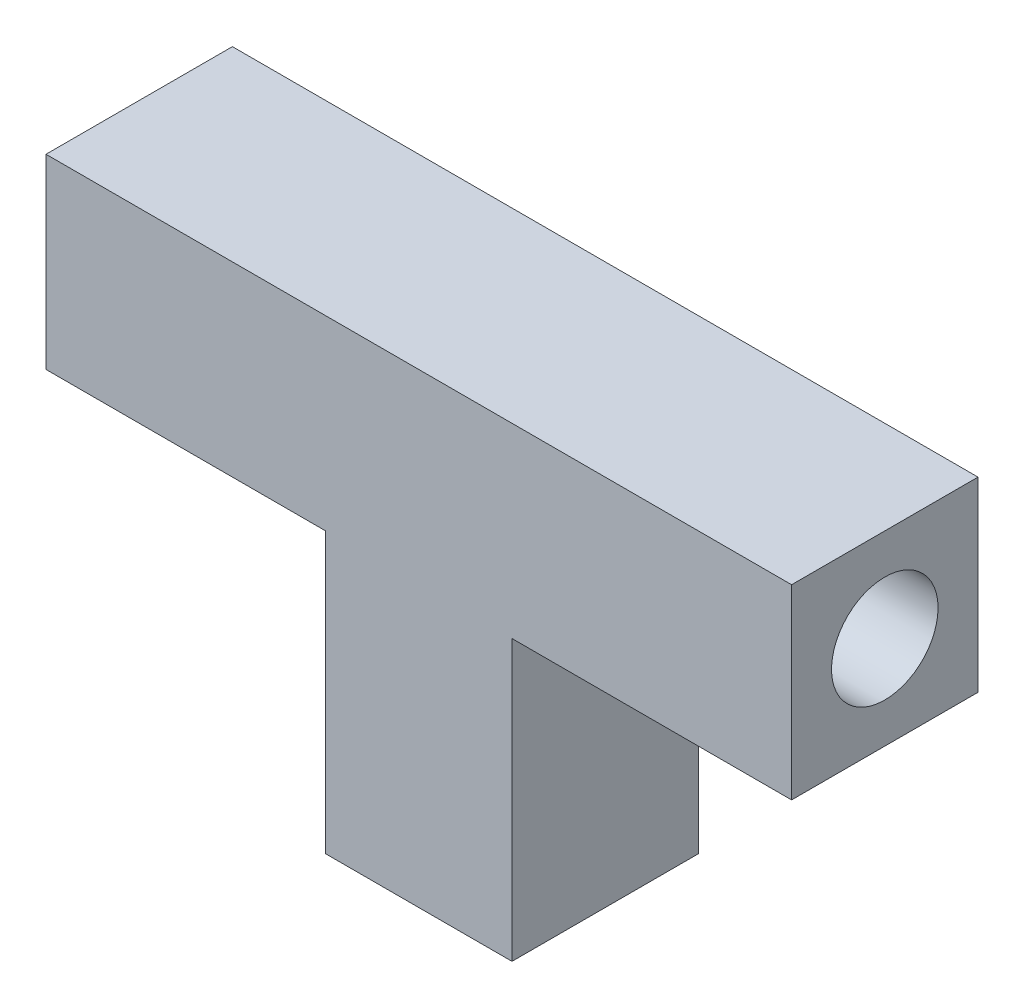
ISO-10303-21;
HEADER;
FILE_DESCRIPTION(('STEP AP214'),'2;1');
FILE_NAME('part.step','',(''),(''),'','','');
FILE_SCHEMA(('AUTOMOTIVE_DESIGN { 1 0 10303 214 1 1 1 1 }'));
ENDSEC;
DATA;
#1=APPLICATION_CONTEXT('core data for automotive mechanical design processes');
#2=APPLICATION_PROTOCOL_DEFINITION('international standard','automotive_design',2000,#1);
#3=PRODUCT_CONTEXT('',#1,'mechanical');
#4=PRODUCT('Part','Part','',(#3));
#5=PRODUCT_RELATED_PRODUCT_CATEGORY('part','',(#4));
#6=PRODUCT_DEFINITION_FORMATION('','',#4);
#7=PRODUCT_DEFINITION_CONTEXT('part definition',#1,'design');
#8=PRODUCT_DEFINITION('design','',#6,#7);
#9=PRODUCT_DEFINITION_SHAPE('','',#8);
#10=(LENGTH_UNIT() NAMED_UNIT(*) SI_UNIT(.MILLI.,.METRE.));
#11=(NAMED_UNIT(*) PLANE_ANGLE_UNIT() SI_UNIT($,.RADIAN.));
#12=(NAMED_UNIT(*) SI_UNIT($,.STERADIAN.) SOLID_ANGLE_UNIT());
#13=UNCERTAINTY_MEASURE_WITH_UNIT(LENGTH_MEASURE(1.E-05),#10,'distance_accuracy_value','');
#14=(GEOMETRIC_REPRESENTATION_CONTEXT(3) GLOBAL_UNCERTAINTY_ASSIGNED_CONTEXT((#13)) GLOBAL_UNIT_ASSIGNED_CONTEXT((#10,
#11,#12)) REPRESENTATION_CONTEXT('',''));
#15=CARTESIAN_POINT('',(0.,0.,0.));
#16=DIRECTION('',(0.,0.,1.));
#17=DIRECTION('',(1.,0.,0.));
#18=AXIS2_PLACEMENT_3D('',#15,#16,#17);
#19=CARTESIAN_POINT('',(-7.,-1.75,1.75));
#20=DIRECTION('',(1.,0.,0.));
#21=DIRECTION('',(0.,0.,-1.));
#22=AXIS2_PLACEMENT_3D('',#19,#20,#21);
#23=PLANE('',#22);
#24=CARTESIAN_POINT('',(-7.,0.,0.));
#25=DIRECTION('',(1.,0.,0.));
#26=DIRECTION('',(0.,0.,-1.));
#27=AXIS2_PLACEMENT_3D('',#24,#25,#26);
#28=CIRCLE('',#27,1.);
#29=CARTESIAN_POINT('',(-7.,0.,-1.));
#30=VERTEX_POINT('',#29);
#31=EDGE_CURVE('E153',#30,#30,#28,.T.);
#32=ORIENTED_EDGE('',*,*,#31,.T.);
#33=EDGE_LOOP('',(#32));
#34=FACE_BOUND('',#33,.T.);
#35=DIRECTION('',(0.,-1.,0.));
#36=VECTOR('',#35,1.);
#37=CARTESIAN_POINT('',(-7.,-1.75,-1.75));
#38=LINE('',#37,#36);
#39=CARTESIAN_POINT('',(-7.,1.75,-1.75));
#40=VERTEX_POINT('',#39);
#41=CARTESIAN_POINT('',(-7.,-1.75,-1.75));
#42=VERTEX_POINT('',#41);
#43=EDGE_CURVE('E148',#40,#42,#38,.T.);
#44=ORIENTED_EDGE('',*,*,#43,.T.);
#45=DIRECTION('',(0.,0.,-1.));
#46=VECTOR('',#45,1.);
#47=CARTESIAN_POINT('',(-7.,-1.75,1.75));
#48=LINE('',#47,#46);
#49=CARTESIAN_POINT('',(-7.,-1.75,1.75));
#50=VERTEX_POINT('',#49);
#51=EDGE_CURVE('E191',#50,#42,#48,.T.);
#52=ORIENTED_EDGE('',*,*,#51,.F.);
#53=DIRECTION('',(0.,-1.,0.));
#54=VECTOR('',#53,1.);
#55=CARTESIAN_POINT('',(-7.,-1.75,1.75));
#56=LINE('',#55,#54);
#57=CARTESIAN_POINT('',(-7.,1.75,1.75));
#58=VERTEX_POINT('',#57);
#59=EDGE_CURVE('E172',#58,#50,#56,.T.);
#60=ORIENTED_EDGE('',*,*,#59,.F.);
#61=DIRECTION('',(0.,0.,-1.));
#62=VECTOR('',#61,1.);
#63=CARTESIAN_POINT('',(-7.,1.75,1.75));
#64=LINE('',#63,#62);
#65=EDGE_CURVE('E144',#58,#40,#64,.T.);
#66=ORIENTED_EDGE('',*,*,#65,.T.);
#67=EDGE_LOOP('',(#44,#52,#60,#66));
#68=FACE_BOUND('',#67,.T.);
#69=ADVANCED_FACE('F39',(#34,#68),#23,.F.);
#70=CARTESIAN_POINT('',(-1.75,-1.75,1.75));
#71=DIRECTION('',(0.,1.,0.));
#72=DIRECTION('',(0.,0.,1.));
#73=AXIS2_PLACEMENT_3D('',#70,#71,#72);
#74=PLANE('',#73);
#75=DIRECTION('',(1.,0.,0.));
#76=VECTOR('',#75,1.);
#77=CARTESIAN_POINT('',(-1.75,-1.75,-1.75));
#78=LINE('',#77,#76);
#79=CARTESIAN_POINT('',(-1.75,-1.75,-1.75));
#80=VERTEX_POINT('',#79);
#81=EDGE_CURVE('E152',#42,#80,#78,.T.);
#82=ORIENTED_EDGE('',*,*,#81,.T.);
#83=DIRECTION('',(0.,0.,-1.));
#84=VECTOR('',#83,1.);
#85=CARTESIAN_POINT('',(-1.75,-1.75,1.75));
#86=LINE('',#85,#84);
#87=CARTESIAN_POINT('',(-1.75,-1.75,1.75));
#88=VERTEX_POINT('',#87);
#89=EDGE_CURVE('E187',#88,#80,#86,.T.);
#90=ORIENTED_EDGE('',*,*,#89,.F.);
#91=DIRECTION('',(1.,0.,0.));
#92=VECTOR('',#91,1.);
#93=CARTESIAN_POINT('',(-1.75,-1.75,1.75));
#94=LINE('',#93,#92);
#95=EDGE_CURVE('E102',#50,#88,#94,.T.);
#96=ORIENTED_EDGE('',*,*,#95,.F.);
#97=ORIENTED_EDGE('',*,*,#51,.T.);
#98=EDGE_LOOP('',(#82,#90,#96,#97));
#99=FACE_BOUND('',#98,.T.);
#100=ADVANCED_FACE('F208',(#99),#74,.F.);
#101=CARTESIAN_POINT('',(-1.75,-7.,1.75));
#102=DIRECTION('',(1.,0.,0.));
#103=DIRECTION('',(0.,0.,-1.));
#104=AXIS2_PLACEMENT_3D('',#101,#102,#103);
#105=PLANE('',#104);
#106=DIRECTION('',(0.,-1.,0.));
#107=VECTOR('',#106,1.);
#108=CARTESIAN_POINT('',(-1.75,-7.,-1.75));
#109=LINE('',#108,#107);
#110=CARTESIAN_POINT('',(-1.75,-7.,-1.75));
#111=VERTEX_POINT('',#110);
#112=EDGE_CURVE('E156',#80,#111,#109,.T.);
#113=ORIENTED_EDGE('',*,*,#112,.T.);
#114=DIRECTION('',(0.,0.,-1.));
#115=VECTOR('',#114,1.);
#116=CARTESIAN_POINT('',(-1.75,-7.,1.75));
#117=LINE('',#116,#115);
#118=CARTESIAN_POINT('',(-1.75,-7.,1.75));
#119=VERTEX_POINT('',#118);
#120=EDGE_CURVE('E183',#119,#111,#117,.T.);
#121=ORIENTED_EDGE('',*,*,#120,.F.);
#122=DIRECTION('',(0.,-1.,0.));
#123=VECTOR('',#122,1.);
#124=CARTESIAN_POINT('',(-1.75,-7.,1.75));
#125=LINE('',#124,#123);
#126=EDGE_CURVE('E226',#88,#119,#125,.T.);
#127=ORIENTED_EDGE('',*,*,#126,.F.);
#128=ORIENTED_EDGE('',*,*,#89,.T.);
#129=EDGE_LOOP('',(#113,#121,#127,#128));
#130=FACE_BOUND('',#129,.T.);
#131=ADVANCED_FACE('F213',(#130),#105,.F.);
#132=CARTESIAN_POINT('',(1.75,-7.,1.75));
#133=DIRECTION('',(0.,1.,0.));
#134=DIRECTION('',(0.,0.,1.));
#135=AXIS2_PLACEMENT_3D('',#132,#133,#134);
#136=PLANE('',#135);
#137=CARTESIAN_POINT('',(0.,-7.,0.));
#138=DIRECTION('',(0.,1.,0.));
#139=DIRECTION('',(0.,0.,1.));
#140=AXIS2_PLACEMENT_3D('',#137,#138,#139);
#141=CIRCLE('',#140,1.);
#142=CARTESIAN_POINT('',(0.,-7.,1.));
#143=VERTEX_POINT('',#142);
#144=EDGE_CURVE('E245',#143,#143,#141,.F.);
#145=ORIENTED_EDGE('',*,*,#144,.F.);
#146=EDGE_LOOP('',(#145));
#147=FACE_BOUND('',#146,.T.);
#148=DIRECTION('',(1.,0.,0.));
#149=VECTOR('',#148,1.);
#150=CARTESIAN_POINT('',(1.75,-7.,-1.75));
#151=LINE('',#150,#149);
#152=CARTESIAN_POINT('',(1.75,-7.,-1.75));
#153=VERTEX_POINT('',#152);
#154=EDGE_CURVE('E159',#111,#153,#151,.T.);
#155=ORIENTED_EDGE('',*,*,#154,.T.);
#156=DIRECTION('',(0.,0.,-1.));
#157=VECTOR('',#156,1.);
#158=CARTESIAN_POINT('',(1.75,-7.,1.75));
#159=LINE('',#158,#157);
#160=CARTESIAN_POINT('',(1.75,-7.,1.75));
#161=VERTEX_POINT('',#160);
#162=EDGE_CURVE('E179',#161,#153,#159,.T.);
#163=ORIENTED_EDGE('',*,*,#162,.F.);
#164=DIRECTION('',(1.,0.,0.));
#165=VECTOR('',#164,1.);
#166=CARTESIAN_POINT('',(1.75,-7.,1.75));
#167=LINE('',#166,#165);
#168=EDGE_CURVE('E229',#119,#161,#167,.T.);
#169=ORIENTED_EDGE('',*,*,#168,.F.);
#170=ORIENTED_EDGE('',*,*,#120,.T.);
#171=EDGE_LOOP('',(#155,#163,#169,#170));
#172=FACE_BOUND('',#171,.T.);
#173=ADVANCED_FACE('F249',(#147,#172),#136,.F.);
#174=CARTESIAN_POINT('',(1.75,-1.75,1.75));
#175=DIRECTION('',(-1.,0.,0.));
#176=DIRECTION('',(0.,-1.,0.));
#177=AXIS2_PLACEMENT_3D('',#174,#175,#176);
#178=PLANE('',#177);
#179=DIRECTION('',(0.,1.,0.));
#180=VECTOR('',#179,1.);
#181=CARTESIAN_POINT('',(1.75,-1.75,-1.75));
#182=LINE('',#181,#180);
#183=CARTESIAN_POINT('',(1.75,-1.75,-1.75));
#184=VERTEX_POINT('',#183);
#185=EDGE_CURVE('E162',#153,#184,#182,.T.);
#186=ORIENTED_EDGE('',*,*,#185,.T.);
#187=DIRECTION('',(0.,0.,-1.));
#188=VECTOR('',#187,1.);
#189=CARTESIAN_POINT('',(1.75,-1.75,1.75));
#190=LINE('',#189,#188);
#191=CARTESIAN_POINT('',(1.75,-1.75,1.75));
#192=VERTEX_POINT('',#191);
#193=EDGE_CURVE('E137',#192,#184,#190,.T.);
#194=ORIENTED_EDGE('',*,*,#193,.F.);
#195=DIRECTION('',(0.,1.,0.));
#196=VECTOR('',#195,1.);
#197=CARTESIAN_POINT('',(1.75,-1.75,1.75));
#198=LINE('',#197,#196);
#199=EDGE_CURVE('E123',#161,#192,#198,.T.);
#200=ORIENTED_EDGE('',*,*,#199,.F.);
#201=ORIENTED_EDGE('',*,*,#162,.T.);
#202=EDGE_LOOP('',(#186,#194,#200,#201));
#203=FACE_BOUND('',#202,.T.);
#204=ADVANCED_FACE('F252',(#203),#178,.F.);
#205=CARTESIAN_POINT('',(7.,-1.75,1.75));
#206=DIRECTION('',(0.,1.,0.));
#207=DIRECTION('',(0.,0.,1.));
#208=AXIS2_PLACEMENT_3D('',#205,#206,#207);
#209=PLANE('',#208);
#210=DIRECTION('',(1.,0.,0.));
#211=VECTOR('',#210,1.);
#212=CARTESIAN_POINT('',(7.,-1.75,-1.75));
#213=LINE('',#212,#211);
#214=CARTESIAN_POINT('',(7.,-1.75,-1.75));
#215=VERTEX_POINT('',#214);
#216=EDGE_CURVE('E133',#184,#215,#213,.T.);
#217=ORIENTED_EDGE('',*,*,#216,.T.);
#218=DIRECTION('',(0.,0.,-1.));
#219=VECTOR('',#218,1.);
#220=CARTESIAN_POINT('',(7.,-1.75,1.75));
#221=LINE('',#220,#219);
#222=CARTESIAN_POINT('',(7.,-1.75,1.75));
#223=VERTEX_POINT('',#222);
#224=EDGE_CURVE('E130',#223,#215,#221,.T.);
#225=ORIENTED_EDGE('',*,*,#224,.F.);
#226=DIRECTION('',(1.,0.,0.));
#227=VECTOR('',#226,1.);
#228=CARTESIAN_POINT('',(7.,-1.75,1.75));
#229=LINE('',#228,#227);
#230=EDGE_CURVE('E116',#192,#223,#229,.T.);
#231=ORIENTED_EDGE('',*,*,#230,.F.);
#232=ORIENTED_EDGE('',*,*,#193,.T.);
#233=EDGE_LOOP('',(#217,#225,#231,#232));
#234=FACE_BOUND('',#233,.T.);
#235=ADVANCED_FACE('F131',(#234),#209,.F.);
#236=CARTESIAN_POINT('',(7.,1.75,1.75));
#237=DIRECTION('',(-1.,0.,0.));
#238=DIRECTION('',(0.,0.,1.));
#239=AXIS2_PLACEMENT_3D('',#236,#237,#238);
#240=PLANE('',#239);
#241=CARTESIAN_POINT('',(7.,0.,0.));
#242=DIRECTION('',(1.,0.,0.));
#243=DIRECTION('',(0.,0.,-1.));
#244=AXIS2_PLACEMENT_3D('',#241,#242,#243);
#245=CIRCLE('',#244,1.);
#246=CARTESIAN_POINT('',(7.,0.,-1.));
#247=VERTEX_POINT('',#246);
#248=EDGE_CURVE('E241',#247,#247,#245,.T.);
#249=ORIENTED_EDGE('',*,*,#248,.F.);
#250=EDGE_LOOP('',(#249));
#251=FACE_BOUND('',#250,.T.);
#252=DIRECTION('',(0.,1.,0.));
#253=VECTOR('',#252,1.);
#254=CARTESIAN_POINT('',(7.,1.75,-1.75));
#255=LINE('',#254,#253);
#256=CARTESIAN_POINT('',(7.,1.75,-1.75));
#257=VERTEX_POINT('',#256);
#258=EDGE_CURVE('E167',#215,#257,#255,.T.);
#259=ORIENTED_EDGE('',*,*,#258,.T.);
#260=DIRECTION('',(0.,0.,-1.));
#261=VECTOR('',#260,1.);
#262=CARTESIAN_POINT('',(7.,1.75,1.75));
#263=LINE('',#262,#261);
#264=CARTESIAN_POINT('',(7.,1.75,1.75));
#265=VERTEX_POINT('',#264);
#266=EDGE_CURVE('E138',#265,#257,#263,.T.);
#267=ORIENTED_EDGE('',*,*,#266,.F.);
#268=DIRECTION('',(0.,1.,0.));
#269=VECTOR('',#268,1.);
#270=CARTESIAN_POINT('',(7.,1.75,1.75));
#271=LINE('',#270,#269);
#272=EDGE_CURVE('E120',#223,#265,#271,.T.);
#273=ORIENTED_EDGE('',*,*,#272,.F.);
#274=ORIENTED_EDGE('',*,*,#224,.T.);
#275=EDGE_LOOP('',(#259,#267,#273,#274));
#276=FACE_BOUND('',#275,.T.);
#277=ADVANCED_FACE('F140',(#251,#276),#240,.F.);
#278=CARTESIAN_POINT('',(-7.,1.75,1.75));
#279=DIRECTION('',(0.,-1.,0.));
#280=DIRECTION('',(0.,0.,-1.));
#281=AXIS2_PLACEMENT_3D('',#278,#279,#280);
#282=PLANE('',#281);
#283=DIRECTION('',(-1.,0.,0.));
#284=VECTOR('',#283,1.);
#285=CARTESIAN_POINT('',(-7.,1.75,-1.75));
#286=LINE('',#285,#284);
#287=EDGE_CURVE('E93',#257,#40,#286,.T.);
#288=ORIENTED_EDGE('',*,*,#287,.T.);
#289=ORIENTED_EDGE('',*,*,#65,.F.);
#290=DIRECTION('',(-1.,0.,0.));
#291=VECTOR('',#290,1.);
#292=CARTESIAN_POINT('',(-7.,1.75,1.75));
#293=LINE('',#292,#291);
#294=EDGE_CURVE('E60',#265,#58,#293,.T.);
#295=ORIENTED_EDGE('',*,*,#294,.F.);
#296=ORIENTED_EDGE('',*,*,#266,.T.);
#297=EDGE_LOOP('',(#288,#289,#295,#296));
#298=FACE_BOUND('',#297,.T.);
#299=ADVANCED_FACE('F257',(#298),#282,.F.);
#300=CARTESIAN_POINT('',(0.,0.,1.75));
#301=DIRECTION('',(0.,0.,-1.));
#302=DIRECTION('',(-1.,0.,0.));
#303=AXIS2_PLACEMENT_3D('',#300,#301,#302);
#304=PLANE('',#303);
#305=ORIENTED_EDGE('',*,*,#59,.T.);
#306=ORIENTED_EDGE('',*,*,#95,.T.);
#307=ORIENTED_EDGE('',*,*,#126,.T.);
#308=ORIENTED_EDGE('',*,*,#168,.T.);
#309=ORIENTED_EDGE('',*,*,#199,.T.);
#310=ORIENTED_EDGE('',*,*,#230,.T.);
#311=ORIENTED_EDGE('',*,*,#272,.T.);
#312=ORIENTED_EDGE('',*,*,#294,.T.);
#313=EDGE_LOOP('',(#305,#306,#307,#308,#309,#310,#311,#312));
#314=FACE_BOUND('',#313,.T.);
#315=ADVANCED_FACE('F118',(#314),#304,.F.);
#316=CARTESIAN_POINT('',(0.,0.,-1.75));
#317=DIRECTION('',(0.,0.,-1.));
#318=DIRECTION('',(-1.,0.,0.));
#319=AXIS2_PLACEMENT_3D('',#316,#317,#318);
#320=PLANE('',#319);
#321=ORIENTED_EDGE('',*,*,#43,.F.);
#322=ORIENTED_EDGE('',*,*,#287,.F.);
#323=ORIENTED_EDGE('',*,*,#258,.F.);
#324=ORIENTED_EDGE('',*,*,#216,.F.);
#325=ORIENTED_EDGE('',*,*,#185,.F.);
#326=ORIENTED_EDGE('',*,*,#154,.F.);
#327=ORIENTED_EDGE('',*,*,#112,.F.);
#328=ORIENTED_EDGE('',*,*,#81,.F.);
#329=EDGE_LOOP('',(#321,#322,#323,#324,#325,#326,#327,#328));
#330=FACE_BOUND('',#329,.T.);
#331=ADVANCED_FACE('F204',(#330),#320,.T.);
#332=CARTESIAN_POINT('',(-7.,0.,0.));
#333=DIRECTION('',(1.,0.,0.));
#334=DIRECTION('',(0.,0.,-1.));
#335=AXIS2_PLACEMENT_3D('',#332,#333,#334);
#336=CYLINDRICAL_SURFACE('',#335,1.);
#337=CARTESIAN_POINT('',(0.,0.,0.));
#338=DIRECTION('',(0.707106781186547,-0.707106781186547,0.));
#339=DIRECTION('',(0.707106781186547,0.707106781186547,0.));
#340=AXIS2_PLACEMENT_3D('',#337,#338,#339);
#341=ELLIPSE('',#340,1.41421356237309,1.);
#342=CARTESIAN_POINT('',(0.,0.,1.));
#343=VERTEX_POINT('',#342);
#344=CARTESIAN_POINT('',(0.,0.,-1.));
#345=VERTEX_POINT('',#344);
#346=EDGE_CURVE('E47',#343,#345,#341,.T.);
#347=ORIENTED_EDGE('',*,*,#346,.T.);
#348=CARTESIAN_POINT('',(0.,0.,0.));
#349=DIRECTION('',(0.707106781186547,0.707106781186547,0.));
#350=DIRECTION('',(0.707106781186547,-0.707106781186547,0.));
#351=AXIS2_PLACEMENT_3D('',#348,#349,#350);
#352=ELLIPSE('',#351,1.41421356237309,1.);
#353=EDGE_CURVE('E11',#345,#343,#352,.F.);
#354=ORIENTED_EDGE('',*,*,#353,.T.);
#355=EDGE_LOOP('',(#347,#354));
#356=FACE_BOUND('',#355,.T.);
#357=ORIENTED_EDGE('',*,*,#31,.F.);
#358=EDGE_LOOP('',(#357));
#359=FACE_BOUND('',#358,.T.);
#360=ORIENTED_EDGE('',*,*,#248,.T.);
#361=EDGE_LOOP('',(#360));
#362=FACE_BOUND('',#361,.T.);
#363=ADVANCED_FACE('F195',(#356,#359,#362),#336,.F.);
#364=CARTESIAN_POINT('',(0.,-9.82842712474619,0.));
#365=DIRECTION('',(0.,1.,0.));
#366=DIRECTION('',(0.,0.,1.));
#367=AXIS2_PLACEMENT_3D('',#364,#365,#366);
#368=CYLINDRICAL_SURFACE('',#367,1.);
#369=ORIENTED_EDGE('',*,*,#144,.T.);
#370=EDGE_LOOP('',(#369));
#371=FACE_BOUND('',#370,.T.);
#372=ORIENTED_EDGE('',*,*,#346,.F.);
#373=ORIENTED_EDGE('',*,*,#353,.F.);
#374=EDGE_LOOP('',(#372,#373));
#375=FACE_BOUND('',#374,.T.);
#376=ADVANCED_FACE('F197',(#371,#375),#368,.F.);
#377=CLOSED_SHELL('',(#69,#100,#131,#173,#204,#235,#277,#299,#315,#331,#363,#376));
#378=MANIFOLD_SOLID_BREP('B2',#377);
#379=ADVANCED_BREP_SHAPE_REPRESENTATION('',(#18,#378),#14);
#380=SHAPE_DEFINITION_REPRESENTATION(#9,#379);
ENDSEC;
END-ISO-10303-21;
